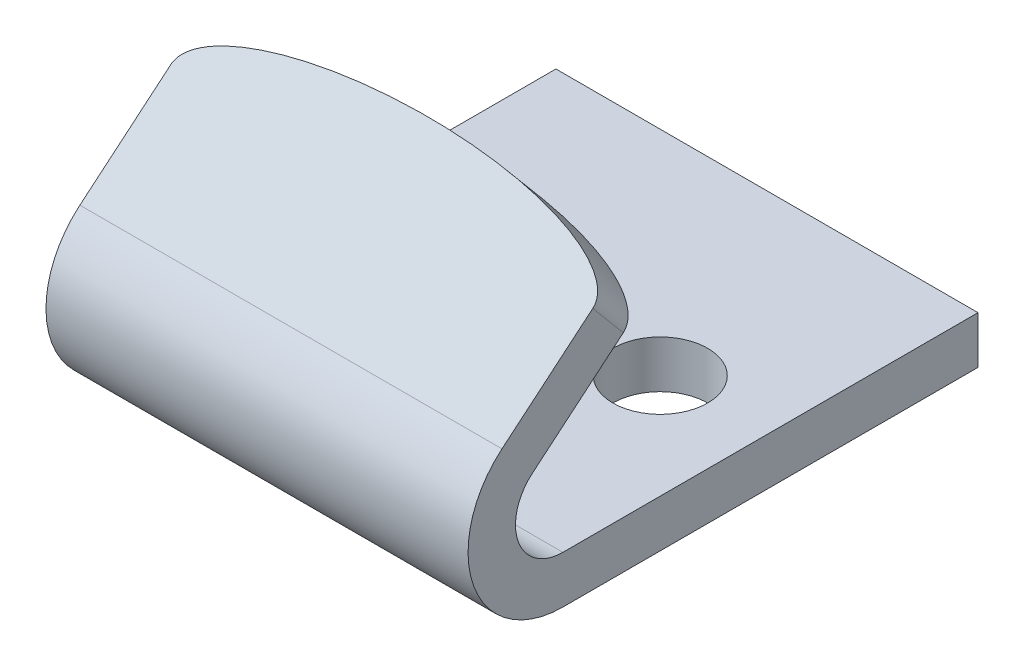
ISO-10303-21;
HEADER;
FILE_DESCRIPTION(('STEP AP214'),'2;1');
FILE_NAME('part.step','',(''),(''),'','','');
FILE_SCHEMA(('AUTOMOTIVE_DESIGN { 1 0 10303 214 1 1 1 1 }'));
ENDSEC;
DATA;
#1=APPLICATION_CONTEXT('core data for automotive mechanical design processes');
#2=APPLICATION_PROTOCOL_DEFINITION('international standard','automotive_design',2000,#1);
#3=PRODUCT_CONTEXT('',#1,'mechanical');
#4=PRODUCT('Part','Part','',(#3));
#5=PRODUCT_RELATED_PRODUCT_CATEGORY('part','',(#4));
#6=PRODUCT_DEFINITION_FORMATION('','',#4);
#7=PRODUCT_DEFINITION_CONTEXT('part definition',#1,'design');
#8=PRODUCT_DEFINITION('design','',#6,#7);
#9=PRODUCT_DEFINITION_SHAPE('','',#8);
#10=(LENGTH_UNIT() NAMED_UNIT(*) SI_UNIT(.MILLI.,.METRE.));
#11=(NAMED_UNIT(*) PLANE_ANGLE_UNIT() SI_UNIT($,.RADIAN.));
#12=(NAMED_UNIT(*) SI_UNIT($,.STERADIAN.) SOLID_ANGLE_UNIT());
#13=UNCERTAINTY_MEASURE_WITH_UNIT(LENGTH_MEASURE(1.E-05),#10,'distance_accuracy_value','');
#14=(GEOMETRIC_REPRESENTATION_CONTEXT(3) GLOBAL_UNCERTAINTY_ASSIGNED_CONTEXT((#13)) GLOBAL_UNIT_ASSIGNED_CONTEXT((#10,
#11,#12)) REPRESENTATION_CONTEXT('',''));
#15=CARTESIAN_POINT('',(0.,0.,0.));
#16=DIRECTION('',(0.,0.,1.));
#17=DIRECTION('',(1.,0.,0.));
#18=AXIS2_PLACEMENT_3D('',#15,#16,#17);
#19=CARTESIAN_POINT('',(0.,5.6626445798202,4.75152297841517));
#20=DIRECTION('',(0.,-0.766044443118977,-0.64278760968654));
#21=DIRECTION('',(0.,0.64278760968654,-0.766044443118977));
#22=AXIS2_PLACEMENT_3D('',#19,#20,#21);
#23=PLANE('',#22);
#24=DIRECTION('',(1.,0.,0.));
#25=VECTOR('',#24,1.);
#26=CARTESIAN_POINT('',(8.9,3.53208888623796,7.29062038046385));
#27=LINE('',#26,#25);
#28=CARTESIAN_POINT('',(8.9,3.53208888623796,7.29062038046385));
#29=VERTEX_POINT('',#28);
#30=CARTESIAN_POINT('',(-8.9,3.53208888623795,7.29062038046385));
#31=VERTEX_POINT('',#30);
#32=EDGE_CURVE('E86',#29,#31,#27,.F.);
#33=ORIENTED_EDGE('',*,*,#32,.T.);
#34=DIRECTION('',(0.,0.64278760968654,-0.766044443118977));
#35=VECTOR('',#34,1.);
#36=CARTESIAN_POINT('',(-8.9,3.53208888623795,7.29062038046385));
#37=LINE('',#36,#35);
#38=CARTESIAN_POINT('',(-8.9,6.74602693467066,3.46039816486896));
#39=VERTEX_POINT('',#38);
#40=EDGE_CURVE('E84',#31,#39,#37,.T.);
#41=ORIENTED_EDGE('',*,*,#40,.T.);
#42=CARTESIAN_POINT('',(8.9,6.74602693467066,3.46039816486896));
#43=CARTESIAN_POINT('',(8.90001129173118,6.76025296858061,3.44344423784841));
#44=CARTESIAN_POINT('',(8.89895412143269,6.77447474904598,3.42649537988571));
#45=CARTESIAN_POINT('',(8.89479087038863,6.80277496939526,3.39276849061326));
#46=CARTESIAN_POINT('',(8.89168758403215,6.81685357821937,3.37599025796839));
#47=CARTESIAN_POINT('',(8.88357317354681,6.84458917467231,3.34293626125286));
#48=CARTESIAN_POINT('',(8.8785875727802,6.85824926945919,3.32665679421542));
#49=CARTESIAN_POINT('',(8.86685167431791,6.88525343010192,3.29447448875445));
#50=CARTESIAN_POINT('',(8.86010069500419,6.89859737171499,3.27857179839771));
#51=CARTESIAN_POINT('',(8.83322367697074,6.94539165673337,3.22280454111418));
#52=CARTESIAN_POINT('',(8.80863624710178,6.97780558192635,3.18417512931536));
#53=CARTESIAN_POINT('',(8.75174784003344,7.03982233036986,3.1102664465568));
#54=CARTESIAN_POINT('',(8.71940229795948,7.0694074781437,3.0750082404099));
#55=CARTESIAN_POINT('',(8.65380942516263,7.12222402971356,3.01206392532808));
#56=CARTESIAN_POINT('',(8.62119338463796,7.14578580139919,2.98398409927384));
#57=CARTESIAN_POINT('',(8.55292762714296,7.19103341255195,2.93006009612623));
#58=CARTESIAN_POINT('',(8.51727543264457,7.21271769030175,2.90421778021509));
#59=CARTESIAN_POINT('',(8.44366626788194,7.25445903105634,2.85447238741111));
#60=CARTESIAN_POINT('',(8.40570609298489,7.27451373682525,2.83057211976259));
#61=CARTESIAN_POINT('',(8.32806912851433,7.31317012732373,2.78450322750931));
#62=CARTESIAN_POINT('',(8.28839290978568,7.33177228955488,2.76233403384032));
#63=CARTESIAN_POINT('',(8.18783485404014,7.37656328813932,2.70895420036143));
#64=CARTESIAN_POINT('',(8.12612410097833,7.40198181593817,2.6786615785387));
#65=CARTESIAN_POINT('',(8.00053319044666,7.45051546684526,2.62082142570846));
#66=CARTESIAN_POINT('',(7.93665194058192,7.4736294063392,2.59327530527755));
#67=CARTESIAN_POINT('',(7.80717754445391,7.51794833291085,2.54045806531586));
#68=CARTESIAN_POINT('',(7.74158171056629,7.53915005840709,2.51519083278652));
#69=CARTESIAN_POINT('',(7.6091436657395,7.57988584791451,2.4666438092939));
#70=CARTESIAN_POINT('',(7.54230123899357,7.59941961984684,2.44336436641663));
#71=CARTESIAN_POINT('',(7.33963694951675,7.65605109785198,2.37587359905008));
#72=CARTESIAN_POINT('',(7.20233330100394,7.69096148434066,2.33426902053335));
#73=CARTESIAN_POINT('',(6.92533831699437,7.75620545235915,2.2565142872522));
#74=CARTESIAN_POINT('',(6.78564968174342,7.7865438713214,2.22035836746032));
#75=CARTESIAN_POINT('',(6.4813823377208,7.8482061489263,2.14687212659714));
#76=CARTESIAN_POINT('',(6.31648318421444,7.87887372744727,2.11032392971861));
#77=CARTESIAN_POINT('',(5.9849575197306,7.93610732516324,2.04211558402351));
#78=CARTESIAN_POINT('',(5.81833066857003,7.96267251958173,2.0104564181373));
#79=CARTESIAN_POINT('',(5.48353081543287,8.01235645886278,1.95124540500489));
#80=CARTESIAN_POINT('',(5.31535557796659,8.03546894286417,1.92370101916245));
#81=CARTESIAN_POINT('',(4.9780533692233,8.07863570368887,1.87225687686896));
#82=CARTESIAN_POINT('',(4.80892632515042,8.09868974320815,1.84835740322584));
#83=CARTESIAN_POINT('',(4.30018782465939,8.15480945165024,1.78147653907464));
#84=CARTESIAN_POINT('',(3.95947876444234,8.18679541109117,1.74335715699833));
#85=CARTESIAN_POINT('',(3.27623184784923,8.24167461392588,1.67795466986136));
#86=CARTESIAN_POINT('',(2.93369342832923,8.26456487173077,1.65067512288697));
#87=CARTESIAN_POINT('',(2.24795751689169,8.30223594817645,1.60578048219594));
#88=CARTESIAN_POINT('',(1.90476129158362,8.31702636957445,1.5881539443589));
#89=CARTESIAN_POINT('',(1.21790654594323,8.33912305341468,1.56182014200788));
#90=CARTESIAN_POINT('',(0.87424820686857,8.34643168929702,1.55311004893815));
#91=CARTESIAN_POINT('',(0.137404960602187,8.35437780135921,1.54364024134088));
#92=CARTESIAN_POINT('',(-0.25580969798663,8.35390735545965,1.5442008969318));
#93=CARTESIAN_POINT('',(-1.04204870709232,8.34352994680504,1.55656821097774));
#94=CARTESIAN_POINT('',(-1.43507297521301,8.33362038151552,1.56837797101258));
#95=CARTESIAN_POINT('',(-2.21932181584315,8.30390966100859,1.60378582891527));
#96=CARTESIAN_POINT('',(-2.61054844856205,8.28413129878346,1.6273567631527));
#97=CARTESIAN_POINT('',(-3.39122017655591,8.23365533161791,1.68751167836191));
#98=CARTESIAN_POINT('',(-3.78066576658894,8.20296097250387,1.72409179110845));
#99=CARTESIAN_POINT('',(-4.44512107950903,8.13935592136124,1.79989333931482));
#100=CARTESIAN_POINT('',(-4.72085786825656,8.10961644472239,1.83533546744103));
#101=CARTESIAN_POINT('',(-5.13271061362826,8.05917983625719,1.8954434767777));
#102=CARTESIAN_POINT('',(-5.269693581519,8.04139780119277,1.91663528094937));
#103=CARTESIAN_POINT('',(-5.54293516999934,8.00367060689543,1.96159680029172));
#104=CARTESIAN_POINT('',(-5.6791938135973,7.98372551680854,1.98536643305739));
#105=CARTESIAN_POINT('',(-6.00519563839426,7.93292657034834,2.04590626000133));
#106=CARTESIAN_POINT('',(-6.19450273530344,7.900903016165,2.08407044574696));
#107=CARTESIAN_POINT('',(-6.57069459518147,7.83101835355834,2.16735574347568));
#108=CARTESIAN_POINT('',(-6.75757754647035,7.79315312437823,2.21248176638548));
#109=CARTESIAN_POINT('',(-7.03431629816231,7.73085265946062,2.28672856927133));
#110=CARTESIAN_POINT('',(-7.12571078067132,7.70923774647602,2.31248821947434));
#111=CARTESIAN_POINT('',(-7.30718452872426,7.6638450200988,2.36658516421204));
#112=CARTESIAN_POINT('',(-7.39726398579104,7.64006752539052,2.39492207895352));
#113=CARTESIAN_POINT('',(-7.57561738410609,7.58997456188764,2.45462054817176));
#114=CARTESIAN_POINT('',(-7.66389288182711,7.56366140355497,2.48597934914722));
#115=CARTESIAN_POINT('',(-7.83802284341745,7.50794866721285,2.5523752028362));
#116=CARTESIAN_POINT('',(-7.92387835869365,7.47855045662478,2.58741062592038));
#117=CARTESIAN_POINT('',(-8.09321541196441,7.41550958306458,2.66253981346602));
#118=CARTESIAN_POINT('',(-8.17665539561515,7.38181966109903,2.70268989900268));
#119=CARTESIAN_POINT('',(-8.29770543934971,7.32746113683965,2.76747186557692));
#120=CARTESIAN_POINT('',(-8.33738377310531,7.30869704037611,2.78983404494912));
#121=CARTESIAN_POINT('',(-8.41494842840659,7.2697023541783,2.83630610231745));
#122=CARTESIAN_POINT('',(-8.45283521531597,7.2494721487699,2.86041552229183));
#123=CARTESIAN_POINT('',(-8.54329867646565,7.19757533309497,2.92226373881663));
#124=CARTESIAN_POINT('',(-8.59456667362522,7.16494622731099,2.96114959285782));
#125=CARTESIAN_POINT('',(-8.68945348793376,7.09533284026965,3.04411159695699));
#126=CARTESIAN_POINT('',(-8.73308917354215,7.05835847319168,3.08817593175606));
#127=CARTESIAN_POINT('',(-8.79475962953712,6.99374391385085,3.16518056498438));
#128=CARTESIAN_POINT('',(-8.81635922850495,6.96752431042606,3.19642787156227));
#129=CARTESIAN_POINT('',(-8.8529443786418,6.91328427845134,3.26106862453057));
#130=CARTESIAN_POINT('',(-8.86795243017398,6.88527035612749,3.29445431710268));
#131=CARTESIAN_POINT('',(-8.88578938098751,6.8385831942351,3.35009391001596));
#132=CARTESIAN_POINT('',(-8.89107026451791,6.82029220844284,3.37189225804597));
#133=CARTESIAN_POINT('',(-8.89819749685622,6.78335106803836,3.41591699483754));
#134=CARTESIAN_POINT('',(-8.90002763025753,6.76469963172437,3.43814491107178));
#135=CARTESIAN_POINT('',(-8.9,6.74602693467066,3.46039816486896));
#136=B_SPLINE_CURVE_WITH_KNOTS('',3,(#42,#43,#44,#45,#46,#47,#48,#49,#50,#51,#52,#53,#54,#55,
#56,#57,#58,#59,#60,#61,#62,#63,#64,#65,#66,#67,#68,#69,#70,#71,#72,#73,#74,#75,#76,#77,#78,#79,
#80,#81,#82,#83,#84,#85,#86,#87,#88,#89,#90,#91,#92,#93,#94,#95,#96,#97,#98,#99,#100,#101,#102,
#103,#104,#105,#106,#107,#108,#109,#110,#111,#112,#113,#114,#115,#116,#117,#118,#119,#120,#121,
#122,#123,#124,#125,#126,#127,#128,#129,#130,#131,#132,#133,#134,#135),.UNSPECIFIED.,.F.,.F.,(4,
2,2,2,2,2,2,2,2,2,2,2,2,2,2,2,2,2,2,2,2,2,2,2,2,2,2,2,2,2,2,2,2,2,2,2,2,2,2,2,2,2,2,2,2,2,4),
(0.,0.0663594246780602,0.132628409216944,0.198029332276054,0.263455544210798,0.430729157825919,
0.598987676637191,0.745968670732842,0.89307077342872,1.04038201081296,1.18764461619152,
1.40736095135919,1.62718955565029,1.84738628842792,2.06762150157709,2.51029923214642,
2.95250524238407,3.46732718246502,3.98225249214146,4.49810047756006,5.0139884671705,
6.04656197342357,7.07947413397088,8.11115906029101,9.14251660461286,10.3218868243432,
11.5015823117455,12.6785656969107,13.8551994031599,14.6937322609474,15.1129419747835,
15.5321382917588,16.1192281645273,16.7067340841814,16.9988349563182,17.2908928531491,
17.5826871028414,17.8743525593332,18.1695641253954,18.3172744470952,18.4649461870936,
18.680905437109,18.8963811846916,19.0344227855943,19.1719894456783,19.2586178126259,
19.3456522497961),.UNSPECIFIED.);
#137=CARTESIAN_POINT('',(8.9,6.74602693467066,3.46039816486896));
#138=VERTEX_POINT('',#137);
#139=EDGE_CURVE('E19',#138,#39,#136,.T.);
#140=ORIENTED_EDGE('',*,*,#139,.F.);
#141=DIRECTION('',(0.,-0.64278760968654,0.766044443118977));
#142=VECTOR('',#141,1.);
#143=CARTESIAN_POINT('',(8.9,6.74602693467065,3.46039816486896));
#144=LINE('',#143,#142);
#145=EDGE_CURVE('E91',#138,#29,#144,.T.);
#146=ORIENTED_EDGE('',*,*,#145,.T.);
#147=EDGE_LOOP('',(#33,#41,#140,#146));
#148=FACE_BOUND('',#147,.T.);
#149=ADVANCED_FACE('F15',(#148),#23,.T.);
#150=CARTESIAN_POINT('',(8.9,6.74602693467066,3.46039816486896));
#151=CARTESIAN_POINT('',(8.9,8.27811582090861,4.74597338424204));
#152=CARTESIAN_POINT('',(8.9,9.95996498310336,-0.369824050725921));
#153=CARTESIAN_POINT('',(8.9,11.4920538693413,0.915751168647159));
#154=CARTESIAN_POINT('',(-8.89999999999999,9.95996498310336,-0.369824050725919));
#155=CARTESIAN_POINT('',(-8.89999999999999,11.4920538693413,0.915751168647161));
#156=CARTESIAN_POINT('',(-8.9,6.74602693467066,3.46039816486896));
#157=CARTESIAN_POINT('',(-8.9,8.27811582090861,4.74597338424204));
#158=(BOUNDED_SURFACE() B_SPLINE_SURFACE(3,1,((#150,#151),(#152,#153),(#154,#155),(#156,#157)),
.UNSPECIFIED.,.F.,.F.,.F.) B_SPLINE_SURFACE_WITH_KNOTS((4,4),(2,2),(0.,1.),(0.,1.),
.UNSPECIFIED.) GEOMETRIC_REPRESENTATION_ITEM() RATIONAL_B_SPLINE_SURFACE(((1.,1.),
(0.333333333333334,0.333333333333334),(0.333333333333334,0.333333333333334),(1.,1.))) REPRESENTATION_ITEM('') SURFACE());
#159=CARTESIAN_POINT('',(-8.9,8.27811582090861,4.74597338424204));
#160=CARTESIAN_POINT('',(-8.90001129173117,8.29234185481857,4.72901945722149));
#161=CARTESIAN_POINT('',(-8.89895412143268,8.30656363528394,4.7120705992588));
#162=CARTESIAN_POINT('',(-8.89479087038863,8.33486385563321,4.67834370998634));
#163=CARTESIAN_POINT('',(-8.89168758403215,8.34894246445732,4.66156547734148));
#164=CARTESIAN_POINT('',(-8.88357317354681,8.37667806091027,4.62851148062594));
#165=CARTESIAN_POINT('',(-8.8785875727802,8.39033815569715,4.6122320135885));
#166=CARTESIAN_POINT('',(-8.86685167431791,8.41734231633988,4.58004970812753));
#167=CARTESIAN_POINT('',(-8.86010069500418,8.43068625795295,4.56414701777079));
#168=CARTESIAN_POINT('',(-8.83322367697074,8.47748054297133,4.50837976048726));
#169=CARTESIAN_POINT('',(-8.80863624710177,8.50989446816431,4.46975034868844));
#170=CARTESIAN_POINT('',(-8.75174784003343,8.57191121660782,4.39584166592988));
#171=CARTESIAN_POINT('',(-8.71940229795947,8.60149636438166,4.36058345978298));
#172=CARTESIAN_POINT('',(-8.65380942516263,8.65431291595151,4.29763914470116));
#173=CARTESIAN_POINT('',(-8.62119338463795,8.67787468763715,4.26955931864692));
#174=CARTESIAN_POINT('',(-8.55292762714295,8.72312229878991,4.21563531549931));
#175=CARTESIAN_POINT('',(-8.51727543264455,8.74480657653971,4.18979299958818));
#176=CARTESIAN_POINT('',(-8.44366626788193,8.7865479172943,4.1400476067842));
#177=CARTESIAN_POINT('',(-8.40570609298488,8.80660262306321,4.11614733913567));
#178=CARTESIAN_POINT('',(-8.32806912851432,8.84525901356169,4.07007844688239));
#179=CARTESIAN_POINT('',(-8.28839290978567,8.86386117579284,4.0479092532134));
#180=CARTESIAN_POINT('',(-8.18783485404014,8.90865217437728,3.99452941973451));
#181=CARTESIAN_POINT('',(-8.12612410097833,8.93407070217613,3.96423679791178));
#182=CARTESIAN_POINT('',(-8.00053319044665,8.98260435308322,3.90639664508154));
#183=CARTESIAN_POINT('',(-7.93665194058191,9.00571829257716,3.87885052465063));
#184=CARTESIAN_POINT('',(-7.8071775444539,9.05003721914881,3.82603328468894));
#185=CARTESIAN_POINT('',(-7.74158171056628,9.07123894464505,3.8007660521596));
#186=CARTESIAN_POINT('',(-7.60914366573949,9.11197473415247,3.75221902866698));
#187=CARTESIAN_POINT('',(-7.54230123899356,9.1315085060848,3.72893958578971));
#188=CARTESIAN_POINT('',(-7.33963694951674,9.18813998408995,3.66144881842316));
#189=CARTESIAN_POINT('',(-7.20233330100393,9.22305037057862,3.61984423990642));
#190=CARTESIAN_POINT('',(-6.92533831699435,9.28829433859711,3.54208950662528));
#191=CARTESIAN_POINT('',(-6.7856496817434,9.31863275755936,3.5059335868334));
#192=CARTESIAN_POINT('',(-6.48138233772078,9.38029503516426,3.43244734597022));
#193=CARTESIAN_POINT('',(-6.31648318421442,9.41096261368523,3.39589914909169));
#194=CARTESIAN_POINT('',(-5.98495751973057,9.4681962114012,3.32769080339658));
#195=CARTESIAN_POINT('',(-5.81833066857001,9.49476140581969,3.29603163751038));
#196=CARTESIAN_POINT('',(-5.48353081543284,9.54444534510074,3.23682062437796));
#197=CARTESIAN_POINT('',(-5.31535557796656,9.56755782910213,3.20927623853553));
#198=CARTESIAN_POINT('',(-4.97805336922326,9.61072458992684,3.15783209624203));
#199=CARTESIAN_POINT('',(-4.80892632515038,9.63077862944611,3.13393262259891));
#200=CARTESIAN_POINT('',(-4.30018782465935,9.6868983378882,3.06705175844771));
#201=CARTESIAN_POINT('',(-3.95947876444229,9.71888429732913,3.02893237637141));
#202=CARTESIAN_POINT('',(-3.27623184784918,9.77376350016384,2.96352988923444));
#203=CARTESIAN_POINT('',(-2.93369342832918,9.79665375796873,2.93625034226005));
#204=CARTESIAN_POINT('',(-2.24795751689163,9.83432483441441,2.89135570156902));
#205=CARTESIAN_POINT('',(-1.90476129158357,9.84911525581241,2.87372916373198));
#206=CARTESIAN_POINT('',(-1.21790654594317,9.87121193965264,2.84739536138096));
#207=CARTESIAN_POINT('',(-0.874248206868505,9.87852057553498,2.83868526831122));
#208=CARTESIAN_POINT('',(-0.137404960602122,9.88646668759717,2.82921546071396));
#209=CARTESIAN_POINT('',(0.255809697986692,9.8859962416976,2.82977611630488));
#210=CARTESIAN_POINT('',(1.04204870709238,9.875618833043,2.84214343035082));
#211=CARTESIAN_POINT('',(1.43507297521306,9.86570926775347,2.85395319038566));
#212=CARTESIAN_POINT('',(2.2193218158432,9.83599854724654,2.88936104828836));
#213=CARTESIAN_POINT('',(2.6105484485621,9.81622018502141,2.91293198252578));
#214=CARTESIAN_POINT('',(3.39122017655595,9.76574421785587,2.97308689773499));
#215=CARTESIAN_POINT('',(3.78066576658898,9.73504985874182,3.00966701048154));
#216=CARTESIAN_POINT('',(4.44512107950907,9.67144480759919,3.0854685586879));
#217=CARTESIAN_POINT('',(4.72085786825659,9.64170533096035,3.12091068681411));
#218=CARTESIAN_POINT('',(5.13271061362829,9.59126872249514,3.18101869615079));
#219=CARTESIAN_POINT('',(5.26969358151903,9.57348668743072,3.20221050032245));
#220=CARTESIAN_POINT('',(5.54293516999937,9.53575949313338,3.24717201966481));
#221=CARTESIAN_POINT('',(5.67919381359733,9.51581440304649,3.27094165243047));
#222=CARTESIAN_POINT('',(6.00519563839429,9.46501545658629,3.33148147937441));
#223=CARTESIAN_POINT('',(6.19450273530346,9.43299190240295,3.36964566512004));
#224=CARTESIAN_POINT('',(6.57069459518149,9.36310723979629,3.45293096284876));
#225=CARTESIAN_POINT('',(6.75757754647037,9.32524201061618,3.49805698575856));
#226=CARTESIAN_POINT('',(7.03431629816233,9.26294154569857,3.57230378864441));
#227=CARTESIAN_POINT('',(7.12571078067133,9.24132663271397,3.59806343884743));
#228=CARTESIAN_POINT('',(7.30718452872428,9.19593390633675,3.65216038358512));
#229=CARTESIAN_POINT('',(7.39726398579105,9.17215641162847,3.6804972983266));
#230=CARTESIAN_POINT('',(7.5756173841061,9.1220634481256,3.74019576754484));
#231=CARTESIAN_POINT('',(7.66389288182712,9.09575028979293,3.7715545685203));
#232=CARTESIAN_POINT('',(7.83802284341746,9.04003755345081,3.83795042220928));
#233=CARTESIAN_POINT('',(7.92387835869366,9.01063934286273,3.87298584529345));
#234=CARTESIAN_POINT('',(8.09321541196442,8.94759846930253,3.9481150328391));
#235=CARTESIAN_POINT('',(8.17665539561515,8.91390854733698,3.98826511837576));
#236=CARTESIAN_POINT('',(8.29770543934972,8.8595500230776,4.05304708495));
#237=CARTESIAN_POINT('',(8.33738377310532,8.84078592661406,4.07540926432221));
#238=CARTESIAN_POINT('',(8.41494842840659,8.80179124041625,4.12188132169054));
#239=CARTESIAN_POINT('',(8.45283521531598,8.78156103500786,4.14599074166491));
#240=CARTESIAN_POINT('',(8.54329867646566,8.72966421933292,4.20783895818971));
#241=CARTESIAN_POINT('',(8.59456667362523,8.69703511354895,4.2467248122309));
#242=CARTESIAN_POINT('',(8.68945348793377,8.6274217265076,4.32968681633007));
#243=CARTESIAN_POINT('',(8.73308917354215,8.59044735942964,4.37375115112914));
#244=CARTESIAN_POINT('',(8.79475962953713,8.52583280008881,4.45075578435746));
#245=CARTESIAN_POINT('',(8.81635922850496,8.49961319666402,4.48200309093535));
#246=CARTESIAN_POINT('',(8.8529443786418,8.4453731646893,4.54664384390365));
#247=CARTESIAN_POINT('',(8.86795243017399,8.41735924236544,4.58002953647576));
#248=CARTESIAN_POINT('',(8.88578938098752,8.37067208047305,4.63566912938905));
#249=CARTESIAN_POINT('',(8.89107026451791,8.3523810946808,4.65746747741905));
#250=CARTESIAN_POINT('',(8.89819749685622,8.31543995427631,4.70149221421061));
#251=CARTESIAN_POINT('',(8.90002763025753,8.29678851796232,4.72372013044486));
#252=CARTESIAN_POINT('',(8.9,8.27811582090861,4.74597338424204));
#253=B_SPLINE_CURVE_WITH_KNOTS('',3,(#159,#160,#161,#162,#163,#164,#165,#166,#167,#168,#169,
#170,#171,#172,#173,#174,#175,#176,#177,#178,#179,#180,#181,#182,#183,#184,#185,#186,#187,#188,
#189,#190,#191,#192,#193,#194,#195,#196,#197,#198,#199,#200,#201,#202,#203,#204,#205,#206,#207,
#208,#209,#210,#211,#212,#213,#214,#215,#216,#217,#218,#219,#220,#221,#222,#223,#224,#225,#226,
#227,#228,#229,#230,#231,#232,#233,#234,#235,#236,#237,#238,#239,#240,#241,#242,#243,#244,#245,
#246,#247,#248,#249,#250,#251,#252),.UNSPECIFIED.,.F.,.F.,(4,2,2,2,2,2,2,2,2,2,2,2,2,2,2,2,2,2,
2,2,2,2,2,2,2,2,2,2,2,2,2,2,2,2,2,2,2,2,2,2,2,2,2,2,2,2,4),(0.,0.0663594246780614,
0.132628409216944,0.198029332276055,0.2634555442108,0.430729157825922,0.598987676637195,
0.745968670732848,0.893070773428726,1.04038201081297,1.18764461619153,1.40736095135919,
1.6271895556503,1.84738628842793,2.0676215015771,2.51029923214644,2.95250524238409,
3.46732718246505,3.98225249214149,4.49810047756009,5.01398846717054,6.04656197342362,
7.07947413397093,8.11115906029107,9.14251660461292,10.3218868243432,11.5015823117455,
12.6785656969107,13.8551994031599,14.6937322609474,15.1129419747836,15.5321382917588,
16.1192281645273,16.7067340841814,16.9988349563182,17.2908928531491,17.5826871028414,
17.8743525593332,18.1695641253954,18.3172744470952,18.4649461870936,18.680905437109,
18.8963811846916,19.0344227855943,19.1719894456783,19.2586178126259,19.3456522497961),.UNSPECIFIED.);
#254=CARTESIAN_POINT('',(-8.9,8.27811582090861,4.74597338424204));
#255=VERTEX_POINT('',#254);
#256=CARTESIAN_POINT('',(8.9,8.27811582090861,4.74597338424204));
#257=VERTEX_POINT('',#256);
#258=EDGE_CURVE('E134',#255,#257,#253,.T.);
#259=DIRECTION('',(0.,-0.766044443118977,-0.642787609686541));
#260=VECTOR('',#259,1.);
#261=CARTESIAN_POINT('',(8.9,8.2781158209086,4.74597338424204));
#262=LINE('',#261,#260);
#263=EDGE_CURVE('E97',#257,#138,#262,.T.);
#264=DIRECTION('',(0.,0.766044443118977,0.642787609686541));
#265=VECTOR('',#264,1.);
#266=CARTESIAN_POINT('',(-8.9,6.74602693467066,3.46039816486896));
#267=LINE('',#266,#265);
#268=EDGE_CURVE('E90',#39,#255,#267,.T.);
#269=ORIENTED_EDGE('',*,*,#258,.T.);
#270=ORIENTED_EDGE('',*,*,#263,.T.);
#271=ORIENTED_EDGE('',*,*,#139,.T.);
#272=ORIENTED_EDGE('',*,*,#268,.T.);
#273=EDGE_LOOP('',(#269,#270,#271,#272));
#274=FACE_BOUND('',#273,.T.);
#275=ADVANCED_FACE('F94',(#274),#158,.T.);
#276=CARTESIAN_POINT('',(8.9,2.,6.00504516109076));
#277=DIRECTION('',(1.,0.,0.));
#278=DIRECTION('',(0.,0.,-1.));
#279=AXIS2_PLACEMENT_3D('',#276,#277,#278);
#280=CYLINDRICAL_SURFACE('',#279,2.);
#281=CARTESIAN_POINT('',(-8.9,2.,6.00504516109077));
#282=DIRECTION('',(1.,0.,0.));
#283=DIRECTION('',(0.,0.,-1.));
#284=AXIS2_PLACEMENT_3D('',#281,#282,#283);
#285=CIRCLE('',#284,2.);
#286=CARTESIAN_POINT('',(-8.9,0.,6.00504516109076));
#287=VERTEX_POINT('',#286);
#288=EDGE_CURVE('E131',#31,#287,#285,.T.);
#289=ORIENTED_EDGE('',*,*,#288,.F.);
#290=ORIENTED_EDGE('',*,*,#32,.F.);
#291=CARTESIAN_POINT('',(8.9,2.,6.00504516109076));
#292=DIRECTION('',(1.,0.,0.));
#293=DIRECTION('',(0.,0.,-1.));
#294=AXIS2_PLACEMENT_3D('',#291,#292,#293);
#295=CIRCLE('',#294,2.);
#296=CARTESIAN_POINT('',(8.9,0.,6.00504516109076));
#297=VERTEX_POINT('',#296);
#298=EDGE_CURVE('E104',#29,#297,#295,.T.);
#299=ORIENTED_EDGE('',*,*,#298,.T.);
#300=DIRECTION('',(1.,0.,0.));
#301=VECTOR('',#300,1.);
#302=CARTESIAN_POINT('',(0.,0.,6.00504516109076));
#303=LINE('',#302,#301);
#304=EDGE_CURVE('E130',#297,#287,#303,.F.);
#305=ORIENTED_EDGE('',*,*,#304,.T.);
#306=EDGE_LOOP('',(#289,#290,#299,#305));
#307=FACE_BOUND('',#306,.T.);
#308=ADVANCED_FACE('F147',(#307),#280,.F.);
#309=CARTESIAN_POINT('',(0.,7.19473346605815,6.03709819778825));
#310=DIRECTION('',(0.,-0.766044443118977,-0.64278760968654));
#311=DIRECTION('',(0.,0.64278760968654,-0.766044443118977));
#312=AXIS2_PLACEMENT_3D('',#309,#310,#311);
#313=PLANE('',#312);
#314=ORIENTED_EDGE('',*,*,#258,.F.);
#315=DIRECTION('',(0.,0.64278760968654,-0.766044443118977));
#316=VECTOR('',#315,1.);
#317=CARTESIAN_POINT('',(-8.9,7.19473346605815,6.03709819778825));
#318=LINE('',#317,#316);
#319=CARTESIAN_POINT('',(-8.9,5.06417777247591,8.57619559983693));
#320=VERTEX_POINT('',#319);
#321=EDGE_CURVE('E101',#320,#255,#318,.T.);
#322=ORIENTED_EDGE('',*,*,#321,.F.);
#323=DIRECTION('',(1.,0.,0.));
#324=VECTOR('',#323,1.);
#325=CARTESIAN_POINT('',(8.9,5.06417777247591,8.57619559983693));
#326=LINE('',#325,#324);
#327=CARTESIAN_POINT('',(8.9,5.06417777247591,8.57619559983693));
#328=VERTEX_POINT('',#327);
#329=EDGE_CURVE('E119',#328,#320,#326,.F.);
#330=ORIENTED_EDGE('',*,*,#329,.F.);
#331=DIRECTION('',(0.,0.64278760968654,-0.766044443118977));
#332=VECTOR('',#331,1.);
#333=CARTESIAN_POINT('',(8.9,7.19473346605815,6.03709819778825));
#334=LINE('',#333,#332);
#335=EDGE_CURVE('E133',#257,#328,#334,.F.);
#336=ORIENTED_EDGE('',*,*,#335,.F.);
#337=EDGE_LOOP('',(#314,#322,#330,#336));
#338=FACE_BOUND('',#337,.T.);
#339=ADVANCED_FACE('F139',(#338),#313,.F.);
#340=CARTESIAN_POINT('',(0.,0.,0.));
#341=DIRECTION('',(0.,-1.,0.));
#342=DIRECTION('',(0.,0.,-1.));
#343=AXIS2_PLACEMENT_3D('',#340,#341,#342);
#344=PLANE('',#343);
#345=DIRECTION('',(0.,0.,-1.));
#346=VECTOR('',#345,1.);
#347=CARTESIAN_POINT('',(8.9,0.,-11.5));
#348=LINE('',#347,#346);
#349=CARTESIAN_POINT('',(8.9,0.,-11.5));
#350=VERTEX_POINT('',#349);
#351=EDGE_CURVE('E123',#350,#297,#348,.F.);
#352=ORIENTED_EDGE('',*,*,#351,.F.);
#353=DIRECTION('',(-1.,0.,0.));
#354=VECTOR('',#353,1.);
#355=CARTESIAN_POINT('',(8.9,0.,-11.5));
#356=LINE('',#355,#354);
#357=CARTESIAN_POINT('',(-8.9,0.,-11.5));
#358=VERTEX_POINT('',#357);
#359=EDGE_CURVE('E213',#358,#350,#356,.F.);
#360=ORIENTED_EDGE('',*,*,#359,.F.);
#361=DIRECTION('',(0.,0.,1.));
#362=VECTOR('',#361,1.);
#363=CARTESIAN_POINT('',(-8.9,0.,-11.5));
#364=LINE('',#363,#362);
#365=EDGE_CURVE('E118',#287,#358,#364,.F.);
#366=ORIENTED_EDGE('',*,*,#365,.F.);
#367=ORIENTED_EDGE('',*,*,#304,.F.);
#368=EDGE_LOOP('',(#352,#360,#366,#367));
#369=FACE_BOUND('',#368,.T.);
#370=CARTESIAN_POINT('',(-4.5,0.,-2.5));
#371=DIRECTION('',(0.,1.,0.));
#372=DIRECTION('',(0.,0.,1.));
#373=AXIS2_PLACEMENT_3D('',#370,#371,#372);
#374=CIRCLE('',#373,2.);
#375=CARTESIAN_POINT('',(-4.5,0.,-0.5));
#376=VERTEX_POINT('',#375);
#377=EDGE_CURVE('E124',#376,#376,#374,.F.);
#378=ORIENTED_EDGE('',*,*,#377,.T.);
#379=EDGE_LOOP('',(#378));
#380=FACE_BOUND('',#379,.T.);
#381=CARTESIAN_POINT('',(4.5,0.,-2.5));
#382=DIRECTION('',(0.,1.,0.));
#383=DIRECTION('',(0.,0.,1.));
#384=AXIS2_PLACEMENT_3D('',#381,#382,#383);
#385=CIRCLE('',#384,2.);
#386=CARTESIAN_POINT('',(4.5,0.,-0.5));
#387=VERTEX_POINT('',#386);
#388=EDGE_CURVE('E127',#387,#387,#385,.F.);
#389=ORIENTED_EDGE('',*,*,#388,.T.);
#390=EDGE_LOOP('',(#389));
#391=FACE_BOUND('',#390,.T.);
#392=ADVANCED_FACE('F161',(#369,#380,#391),#344,.F.);
#393=CARTESIAN_POINT('',(4.5,-2.00100000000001,-2.5));
#394=DIRECTION('',(0.,1.,0.));
#395=DIRECTION('',(0.,0.,1.));
#396=AXIS2_PLACEMENT_3D('',#393,#394,#395);
#397=CYLINDRICAL_SURFACE('',#396,2.);
#398=ORIENTED_EDGE('',*,*,#388,.F.);
#399=EDGE_LOOP('',(#398));
#400=FACE_BOUND('',#399,.T.);
#401=CARTESIAN_POINT('',(4.5,-2.,-2.5));
#402=DIRECTION('',(0.,1.,0.));
#403=DIRECTION('',(0.,0.,1.));
#404=AXIS2_PLACEMENT_3D('',#401,#402,#403);
#405=CIRCLE('',#404,2.);
#406=CARTESIAN_POINT('',(4.5,-2.,-0.5));
#407=VERTEX_POINT('',#406);
#408=EDGE_CURVE('E113',#407,#407,#405,.T.);
#409=ORIENTED_EDGE('',*,*,#408,.F.);
#410=EDGE_LOOP('',(#409));
#411=FACE_BOUND('',#410,.T.);
#412=ADVANCED_FACE('F190',(#400,#411),#397,.F.);
#413=CARTESIAN_POINT('',(-4.5,-2.00100000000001,-2.5));
#414=DIRECTION('',(0.,1.,0.));
#415=DIRECTION('',(0.,0.,1.));
#416=AXIS2_PLACEMENT_3D('',#413,#414,#415);
#417=CYLINDRICAL_SURFACE('',#416,2.);
#418=ORIENTED_EDGE('',*,*,#377,.F.);
#419=EDGE_LOOP('',(#418));
#420=FACE_BOUND('',#419,.T.);
#421=CARTESIAN_POINT('',(-4.5,-2.,-2.5));
#422=DIRECTION('',(0.,1.,0.));
#423=DIRECTION('',(0.,0.,1.));
#424=AXIS2_PLACEMENT_3D('',#421,#422,#423);
#425=CIRCLE('',#424,2.);
#426=CARTESIAN_POINT('',(-4.5,-2.,-0.5));
#427=VERTEX_POINT('',#426);
#428=EDGE_CURVE('E109',#427,#427,#425,.T.);
#429=ORIENTED_EDGE('',*,*,#428,.F.);
#430=EDGE_LOOP('',(#429));
#431=FACE_BOUND('',#430,.T.);
#432=ADVANCED_FACE('F186',(#420,#431),#417,.F.);
#433=CARTESIAN_POINT('',(8.9,-2.,-11.5));
#434=DIRECTION('',(1.,0.,0.));
#435=DIRECTION('',(0.,0.,-1.));
#436=AXIS2_PLACEMENT_3D('',#433,#434,#435);
#437=PLANE('',#436);
#438=DIRECTION('',(0.,0.,-1.));
#439=VECTOR('',#438,1.);
#440=CARTESIAN_POINT('',(8.9,-2.,0.));
#441=LINE('',#440,#439);
#442=CARTESIAN_POINT('',(8.9,-2.,-11.5));
#443=VERTEX_POINT('',#442);
#444=CARTESIAN_POINT('',(8.9,-2.,6.00504516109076));
#445=VERTEX_POINT('',#444);
#446=EDGE_CURVE('E112',#443,#445,#441,.F.);
#447=ORIENTED_EDGE('',*,*,#446,.F.);
#448=DIRECTION('',(0.,1.,0.));
#449=VECTOR('',#448,1.);
#450=CARTESIAN_POINT('',(8.9,-2.,-11.5));
#451=LINE('',#450,#449);
#452=EDGE_CURVE('E217',#350,#443,#451,.F.);
#453=ORIENTED_EDGE('',*,*,#452,.F.);
#454=ORIENTED_EDGE('',*,*,#351,.T.);
#455=ORIENTED_EDGE('',*,*,#298,.F.);
#456=ORIENTED_EDGE('',*,*,#145,.F.);
#457=ORIENTED_EDGE('',*,*,#263,.F.);
#458=ORIENTED_EDGE('',*,*,#335,.T.);
#459=CARTESIAN_POINT('',(8.9,2.,6.00504516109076));
#460=DIRECTION('',(1.,0.,0.));
#461=DIRECTION('',(0.,0.,-1.));
#462=AXIS2_PLACEMENT_3D('',#459,#460,#461);
#463=CIRCLE('',#462,4.);
#464=EDGE_CURVE('E120',#445,#328,#463,.F.);
#465=ORIENTED_EDGE('',*,*,#464,.F.);
#466=EDGE_LOOP('',(#447,#453,#454,#455,#456,#457,#458,#465));
#467=FACE_BOUND('',#466,.T.);
#468=ADVANCED_FACE('F182',(#467),#437,.T.);
#469=CARTESIAN_POINT('',(8.9,2.,6.00504516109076));
#470=DIRECTION('',(1.,0.,0.));
#471=DIRECTION('',(0.,0.,-1.));
#472=AXIS2_PLACEMENT_3D('',#469,#470,#471);
#473=CYLINDRICAL_SURFACE('',#472,4.);
#474=ORIENTED_EDGE('',*,*,#329,.T.);
#475=CARTESIAN_POINT('',(-8.9,2.,6.00504516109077));
#476=DIRECTION('',(1.,0.,0.));
#477=DIRECTION('',(0.,0.,-1.));
#478=AXIS2_PLACEMENT_3D('',#475,#476,#477);
#479=CIRCLE('',#478,4.);
#480=CARTESIAN_POINT('',(-8.9,-2.,6.00504516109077));
#481=VERTEX_POINT('',#480);
#482=EDGE_CURVE('E116',#320,#481,#479,.T.);
#483=ORIENTED_EDGE('',*,*,#482,.T.);
#484=DIRECTION('',(1.,0.,0.));
#485=VECTOR('',#484,1.);
#486=CARTESIAN_POINT('',(0.,-2.,6.00504516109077));
#487=LINE('',#486,#485);
#488=EDGE_CURVE('E230',#445,#481,#487,.F.);
#489=ORIENTED_EDGE('',*,*,#488,.F.);
#490=ORIENTED_EDGE('',*,*,#464,.T.);
#491=EDGE_LOOP('',(#474,#483,#489,#490));
#492=FACE_BOUND('',#491,.T.);
#493=ADVANCED_FACE('F179',(#492),#473,.T.);
#494=CARTESIAN_POINT('',(-8.9,-2.,-11.5));
#495=DIRECTION('',(-1.,0.,0.));
#496=DIRECTION('',(0.,0.,1.));
#497=AXIS2_PLACEMENT_3D('',#494,#495,#496);
#498=PLANE('',#497);
#499=DIRECTION('',(0.,1.,0.));
#500=VECTOR('',#499,1.);
#501=CARTESIAN_POINT('',(-8.9,-2.,-11.5));
#502=LINE('',#501,#500);
#503=CARTESIAN_POINT('',(-8.9,-2.,-11.5));
#504=VERTEX_POINT('',#503);
#505=EDGE_CURVE('E37',#504,#358,#502,.T.);
#506=ORIENTED_EDGE('',*,*,#505,.F.);
#507=DIRECTION('',(0.,0.,-1.));
#508=VECTOR('',#507,1.);
#509=CARTESIAN_POINT('',(-8.9,-2.,0.));
#510=LINE('',#509,#508);
#511=EDGE_CURVE('E28',#481,#504,#510,.T.);
#512=ORIENTED_EDGE('',*,*,#511,.F.);
#513=ORIENTED_EDGE('',*,*,#482,.F.);
#514=ORIENTED_EDGE('',*,*,#321,.T.);
#515=ORIENTED_EDGE('',*,*,#268,.F.);
#516=ORIENTED_EDGE('',*,*,#40,.F.);
#517=ORIENTED_EDGE('',*,*,#288,.T.);
#518=ORIENTED_EDGE('',*,*,#365,.T.);
#519=EDGE_LOOP('',(#506,#512,#513,#514,#515,#516,#517,#518));
#520=FACE_BOUND('',#519,.T.);
#521=ADVANCED_FACE('F99',(#520),#498,.T.);
#522=CARTESIAN_POINT('',(8.9,-2.,-11.5));
#523=DIRECTION('',(0.,0.,-1.));
#524=DIRECTION('',(-1.,0.,0.));
#525=AXIS2_PLACEMENT_3D('',#522,#523,#524);
#526=PLANE('',#525);
#527=DIRECTION('',(1.,0.,0.));
#528=VECTOR('',#527,1.);
#529=CARTESIAN_POINT('',(0.,-2.,-11.5));
#530=LINE('',#529,#528);
#531=EDGE_CURVE('E10',#504,#443,#530,.T.);
#532=ORIENTED_EDGE('',*,*,#531,.F.);
#533=ORIENTED_EDGE('',*,*,#505,.T.);
#534=ORIENTED_EDGE('',*,*,#359,.T.);
#535=ORIENTED_EDGE('',*,*,#452,.T.);
#536=EDGE_LOOP('',(#532,#533,#534,#535));
#537=FACE_BOUND('',#536,.T.);
#538=ADVANCED_FACE('F165',(#537),#526,.T.);
#539=CARTESIAN_POINT('',(0.,-2.,0.));
#540=DIRECTION('',(0.,-1.,0.));
#541=DIRECTION('',(0.,0.,-1.));
#542=AXIS2_PLACEMENT_3D('',#539,#540,#541);
#543=PLANE('',#542);
#544=ORIENTED_EDGE('',*,*,#511,.T.);
#545=ORIENTED_EDGE('',*,*,#531,.T.);
#546=ORIENTED_EDGE('',*,*,#446,.T.);
#547=ORIENTED_EDGE('',*,*,#488,.T.);
#548=EDGE_LOOP('',(#544,#545,#546,#547));
#549=FACE_BOUND('',#548,.T.);
#550=ORIENTED_EDGE('',*,*,#428,.T.);
#551=EDGE_LOOP('',(#550));
#552=FACE_BOUND('',#551,.T.);
#553=ORIENTED_EDGE('',*,*,#408,.T.);
#554=EDGE_LOOP('',(#553));
#555=FACE_BOUND('',#554,.T.);
#556=ADVANCED_FACE('F163',(#549,#552,#555),#543,.T.);
#557=CLOSED_SHELL('',(#149,#275,#308,#339,#392,#412,#432,#468,#493,#521,#538,#556));
#558=MANIFOLD_SOLID_BREP('B1',#557);
#559=ADVANCED_BREP_SHAPE_REPRESENTATION('',(#18,#558),#14);
#560=SHAPE_DEFINITION_REPRESENTATION(#9,#559);
ENDSEC;
END-ISO-10303-21;
